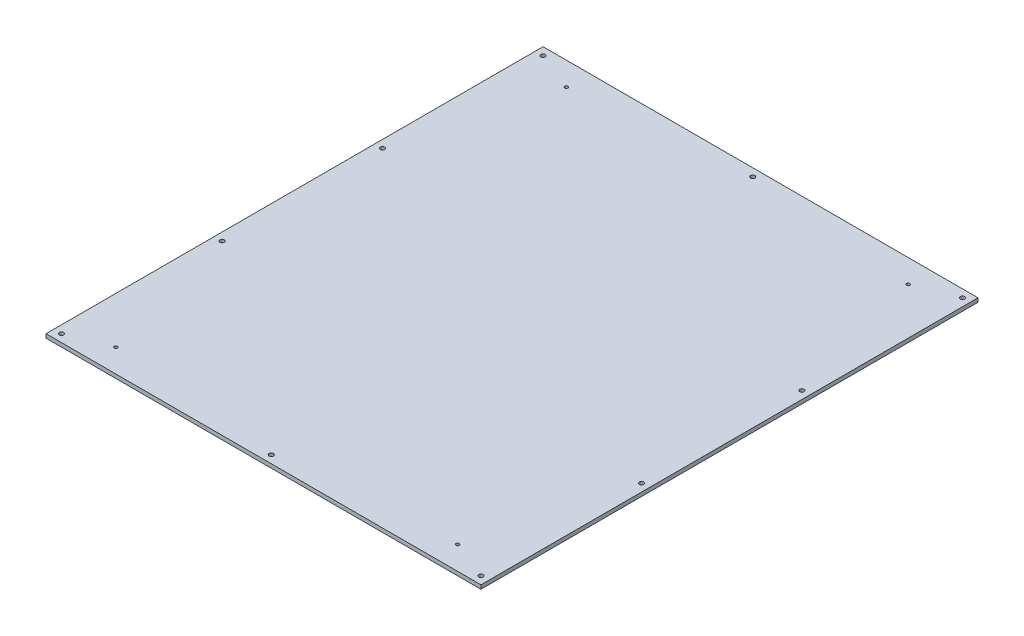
from build123d import *

# Parameters (mm, degrees)
SKETCH1_W                   = 711.2
SKETCH1_H                   = 812.8
BOSS_EXTRUDE1_DEPTH         = 6.35
F_1_4_CLEARANCE_HOLE1_D     = 7.14248
F_1_4_CLEARANCE_HOLE1_DEPTH = 69.85
F_1_4_CLEARANCE_HOLE1_TIP   = 2.145817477
F_1_4_28_TAPPED_HOLE1_D     = 5.4102


with BuildPart() as part:
    # Sketch1 → Boss-Extrude1 (new body)
    with BuildSketch(Plane(origin=(0, 0, 0), x_dir=(1, 0, 0), z_dir=(0, 1, 0))):
        Rectangle(SKETCH1_W, SKETCH1_H)
    extrude(amount=BOSS_EXTRUDE1_DEPTH)

    # 1_4 Clearance Hole1
    with Locations(Plane(origin=(0, 6.35, 0), x_dir=(1, 0, 0), z_dir=(0, 1, 0))):
        with Locations((-342.9, 393.7), (0, 393.7), (342.9, 393.7), (342.9, 131.233333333), (342.9, -131.233333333), (342.9, -393.7), (0, -393.7), (-342.9, -393.7), (-342.9, -131.233333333), (-342.9, 131.233333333)):
            Hole(F_1_4_CLEARANCE_HOLE1_D / 2, depth=F_1_4_CLEARANCE_HOLE1_DEPTH)
            with Locations((0, 0, -(F_1_4_CLEARANCE_HOLE1_DEPTH + F_1_4_CLEARANCE_HOLE1_TIP / 2))):  # 118° drill point
                Cone(0, F_1_4_CLEARANCE_HOLE1_D / 2, F_1_4_CLEARANCE_HOLE1_TIP, mode=Mode.SUBTRACT)

    # 1_4-28 Tapped Hole1 (through all)
    with Locations(Plane(origin=(0, 6.35, 0), x_dir=(1, 0, 0), z_dir=(0, 1, 0))):
        with Locations((-279.4, 368.3), (279.4, 368.3), (279.4, -368.3), (-279.4, -368.3)):
            Hole(F_1_4_28_TAPPED_HOLE1_D / 2)


solid = part.part
